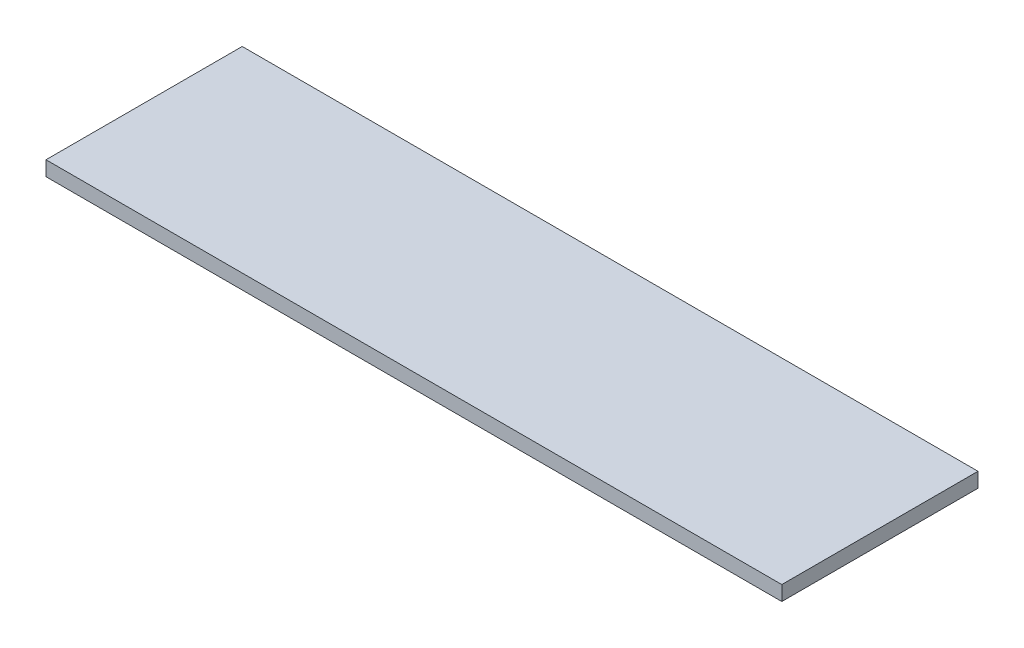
ISO-10303-21;
HEADER;
FILE_DESCRIPTION(('STEP AP214'),'2;1');
FILE_NAME('part.step','',(''),(''),'','','');
FILE_SCHEMA(('AUTOMOTIVE_DESIGN { 1 0 10303 214 1 1 1 1 }'));
ENDSEC;
DATA;
#1=APPLICATION_CONTEXT('core data for automotive mechanical design processes');
#2=APPLICATION_PROTOCOL_DEFINITION('international standard','automotive_design',2000,#1);
#3=PRODUCT_CONTEXT('',#1,'mechanical');
#4=PRODUCT('Part','Part','',(#3));
#5=PRODUCT_RELATED_PRODUCT_CATEGORY('part','',(#4));
#6=PRODUCT_DEFINITION_FORMATION('','',#4);
#7=PRODUCT_DEFINITION_CONTEXT('part definition',#1,'design');
#8=PRODUCT_DEFINITION('design','',#6,#7);
#9=PRODUCT_DEFINITION_SHAPE('','',#8);
#10=(LENGTH_UNIT() NAMED_UNIT(*) SI_UNIT(.MILLI.,.METRE.));
#11=(NAMED_UNIT(*) PLANE_ANGLE_UNIT() SI_UNIT($,.RADIAN.));
#12=(NAMED_UNIT(*) SI_UNIT($,.STERADIAN.) SOLID_ANGLE_UNIT());
#13=UNCERTAINTY_MEASURE_WITH_UNIT(LENGTH_MEASURE(1.E-05),#10,'distance_accuracy_value','');
#14=(GEOMETRIC_REPRESENTATION_CONTEXT(3) GLOBAL_UNCERTAINTY_ASSIGNED_CONTEXT((#13)) GLOBAL_UNIT_ASSIGNED_CONTEXT((#10,
#11,#12)) REPRESENTATION_CONTEXT('',''));
#15=CARTESIAN_POINT('',(0.,0.,0.));
#16=DIRECTION('',(0.,0.,1.));
#17=DIRECTION('',(1.,0.,0.));
#18=AXIS2_PLACEMENT_3D('',#15,#16,#17);
#19=CARTESIAN_POINT('',(75.,3.,-20.));
#20=DIRECTION('',(-1.,0.,0.));
#21=DIRECTION('',(0.,0.,1.));
#22=AXIS2_PLACEMENT_3D('',#19,#20,#21);
#23=PLANE('',#22);
#24=DIRECTION('',(0.,0.,-1.));
#25=VECTOR('',#24,1.);
#26=CARTESIAN_POINT('',(75.,0.,-20.));
#27=LINE('',#26,#25);
#28=CARTESIAN_POINT('',(75.,0.,20.));
#29=VERTEX_POINT('',#28);
#30=CARTESIAN_POINT('',(75.,0.,-20.));
#31=VERTEX_POINT('',#30);
#32=EDGE_CURVE('E98',#29,#31,#27,.T.);
#33=ORIENTED_EDGE('',*,*,#32,.T.);
#34=DIRECTION('',(0.,-1.,0.));
#35=VECTOR('',#34,1.);
#36=CARTESIAN_POINT('',(75.,3.,-20.));
#37=LINE('',#36,#35);
#38=CARTESIAN_POINT('',(75.,3.,-20.));
#39=VERTEX_POINT('',#38);
#40=EDGE_CURVE('E11',#39,#31,#37,.T.);
#41=ORIENTED_EDGE('',*,*,#40,.F.);
#42=DIRECTION('',(0.,0.,-1.));
#43=VECTOR('',#42,1.);
#44=CARTESIAN_POINT('',(75.,3.,-20.));
#45=LINE('',#44,#43);
#46=CARTESIAN_POINT('',(75.,3.,20.));
#47=VERTEX_POINT('',#46);
#48=EDGE_CURVE('E86',#47,#39,#45,.T.);
#49=ORIENTED_EDGE('',*,*,#48,.F.);
#50=DIRECTION('',(0.,-1.,0.));
#51=VECTOR('',#50,1.);
#52=CARTESIAN_POINT('',(75.,3.,20.));
#53=LINE('',#52,#51);
#54=EDGE_CURVE('E94',#47,#29,#53,.T.);
#55=ORIENTED_EDGE('',*,*,#54,.T.);
#56=EDGE_LOOP('',(#33,#41,#49,#55));
#57=FACE_BOUND('',#56,.T.);
#58=ADVANCED_FACE('F35',(#57),#23,.F.);
#59=CARTESIAN_POINT('',(-75.,3.,-20.));
#60=DIRECTION('',(0.,0.,1.));
#61=DIRECTION('',(1.,0.,0.));
#62=AXIS2_PLACEMENT_3D('',#59,#60,#61);
#63=PLANE('',#62);
#64=DIRECTION('',(-1.,0.,0.));
#65=VECTOR('',#64,1.);
#66=CARTESIAN_POINT('',(-75.,0.,-20.));
#67=LINE('',#66,#65);
#68=CARTESIAN_POINT('',(-75.,0.,-20.));
#69=VERTEX_POINT('',#68);
#70=EDGE_CURVE('E90',#31,#69,#67,.T.);
#71=ORIENTED_EDGE('',*,*,#70,.T.);
#72=DIRECTION('',(0.,-1.,0.));
#73=VECTOR('',#72,1.);
#74=CARTESIAN_POINT('',(-75.,3.,-20.));
#75=LINE('',#74,#73);
#76=CARTESIAN_POINT('',(-75.,3.,-20.));
#77=VERTEX_POINT('',#76);
#78=EDGE_CURVE('E43',#77,#69,#75,.T.);
#79=ORIENTED_EDGE('',*,*,#78,.F.);
#80=DIRECTION('',(-1.,0.,0.));
#81=VECTOR('',#80,1.);
#82=CARTESIAN_POINT('',(-75.,3.,-20.));
#83=LINE('',#82,#81);
#84=EDGE_CURVE('E81',#39,#77,#83,.T.);
#85=ORIENTED_EDGE('',*,*,#84,.F.);
#86=ORIENTED_EDGE('',*,*,#40,.T.);
#87=EDGE_LOOP('',(#71,#79,#85,#86));
#88=FACE_BOUND('',#87,.T.);
#89=ADVANCED_FACE('F89',(#88),#63,.F.);
#90=CARTESIAN_POINT('',(-75.,3.,-20.));
#91=DIRECTION('',(1.,0.,0.));
#92=DIRECTION('',(0.,0.,-1.));
#93=AXIS2_PLACEMENT_3D('',#90,#91,#92);
#94=PLANE('',#93);
#95=DIRECTION('',(0.,0.,1.));
#96=VECTOR('',#95,1.);
#97=CARTESIAN_POINT('',(-75.,0.,-20.));
#98=LINE('',#97,#96);
#99=CARTESIAN_POINT('',(-75.,0.,20.));
#100=VERTEX_POINT('',#99);
#101=EDGE_CURVE('E68',#69,#100,#98,.T.);
#102=ORIENTED_EDGE('',*,*,#101,.T.);
#103=DIRECTION('',(0.,-1.,0.));
#104=VECTOR('',#103,1.);
#105=CARTESIAN_POINT('',(-75.,3.,20.));
#106=LINE('',#105,#104);
#107=CARTESIAN_POINT('',(-75.,3.,20.));
#108=VERTEX_POINT('',#107);
#109=EDGE_CURVE('E91',#108,#100,#106,.T.);
#110=ORIENTED_EDGE('',*,*,#109,.F.);
#111=DIRECTION('',(0.,0.,1.));
#112=VECTOR('',#111,1.);
#113=CARTESIAN_POINT('',(-75.,3.,-20.));
#114=LINE('',#113,#112);
#115=EDGE_CURVE('E84',#77,#108,#114,.T.);
#116=ORIENTED_EDGE('',*,*,#115,.F.);
#117=ORIENTED_EDGE('',*,*,#78,.T.);
#118=EDGE_LOOP('',(#102,#110,#116,#117));
#119=FACE_BOUND('',#118,.T.);
#120=ADVANCED_FACE('F92',(#119),#94,.F.);
#121=CARTESIAN_POINT('',(-75.,3.,20.));
#122=DIRECTION('',(0.,0.,-1.));
#123=DIRECTION('',(-1.,0.,0.));
#124=AXIS2_PLACEMENT_3D('',#121,#122,#123);
#125=PLANE('',#124);
#126=DIRECTION('',(1.,0.,0.));
#127=VECTOR('',#126,1.);
#128=CARTESIAN_POINT('',(-75.,0.,20.));
#129=LINE('',#128,#127);
#130=EDGE_CURVE('E74',#100,#29,#129,.T.);
#131=ORIENTED_EDGE('',*,*,#130,.T.);
#132=ORIENTED_EDGE('',*,*,#54,.F.);
#133=DIRECTION('',(1.,0.,0.));
#134=VECTOR('',#133,1.);
#135=CARTESIAN_POINT('',(-75.,3.,20.));
#136=LINE('',#135,#134);
#137=EDGE_CURVE('E51',#108,#47,#136,.T.);
#138=ORIENTED_EDGE('',*,*,#137,.F.);
#139=ORIENTED_EDGE('',*,*,#109,.T.);
#140=EDGE_LOOP('',(#131,#132,#138,#139));
#141=FACE_BOUND('',#140,.T.);
#142=ADVANCED_FACE('F105',(#141),#125,.F.);
#143=CARTESIAN_POINT('',(0.,3.,0.));
#144=DIRECTION('',(0.,1.,0.));
#145=DIRECTION('',(0.,0.,1.));
#146=AXIS2_PLACEMENT_3D('',#143,#144,#145);
#147=PLANE('',#146);
#148=ORIENTED_EDGE('',*,*,#48,.T.);
#149=ORIENTED_EDGE('',*,*,#84,.T.);
#150=ORIENTED_EDGE('',*,*,#115,.T.);
#151=ORIENTED_EDGE('',*,*,#137,.T.);
#152=EDGE_LOOP('',(#148,#149,#150,#151));
#153=FACE_BOUND('',#152,.T.);
#154=ADVANCED_FACE('F82',(#153),#147,.T.);
#155=CARTESIAN_POINT('',(0.,0.,0.));
#156=DIRECTION('',(0.,1.,0.));
#157=DIRECTION('',(0.,0.,1.));
#158=AXIS2_PLACEMENT_3D('',#155,#156,#157);
#159=PLANE('',#158);
#160=ORIENTED_EDGE('',*,*,#32,.F.);
#161=ORIENTED_EDGE('',*,*,#130,.F.);
#162=ORIENTED_EDGE('',*,*,#101,.F.);
#163=ORIENTED_EDGE('',*,*,#70,.F.);
#164=EDGE_LOOP('',(#160,#161,#162,#163));
#165=FACE_BOUND('',#164,.T.);
#166=ADVANCED_FACE('F108',(#165),#159,.F.);
#167=CLOSED_SHELL('',(#58,#89,#120,#142,#154,#166));
#168=MANIFOLD_SOLID_BREP('B2',#167);
#169=ADVANCED_BREP_SHAPE_REPRESENTATION('',(#18,#168),#14);
#170=SHAPE_DEFINITION_REPRESENTATION(#9,#169);
ENDSEC;
END-ISO-10303-21;
